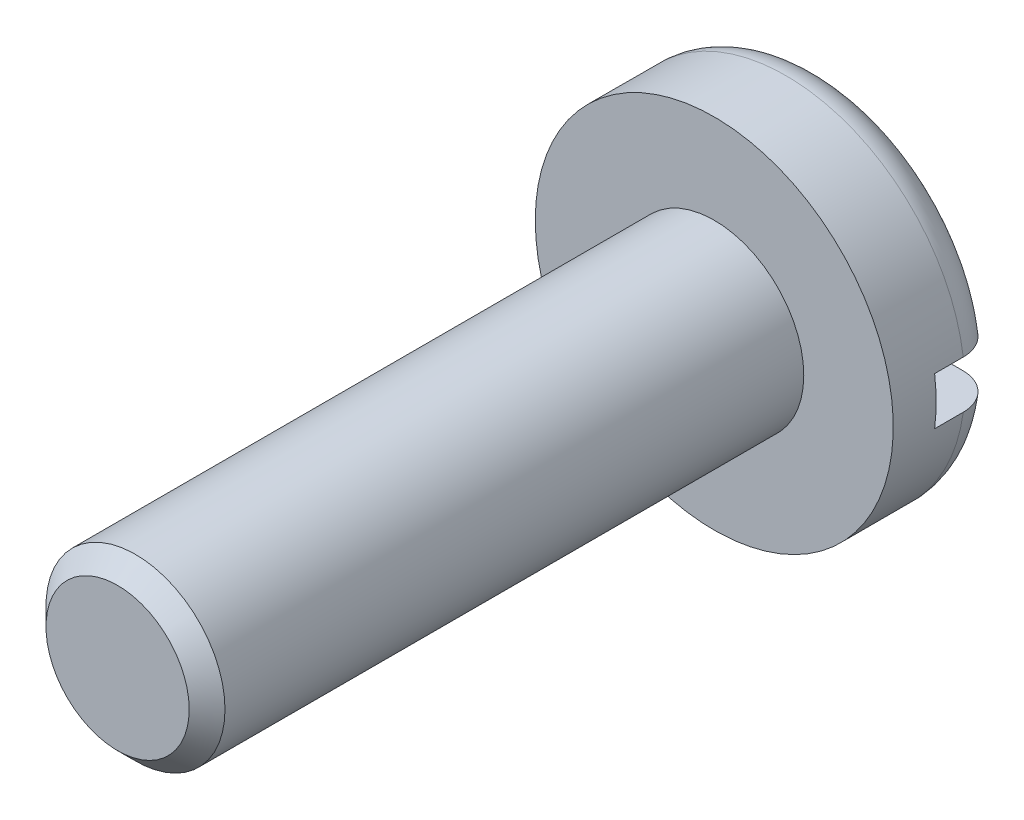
from build123d import *

# Parameters (mm, degrees)
ESQUISSE2_W             = 6
ESQUISSE2_H             = 0.8
ENLEV_MAT_EXTRU_1_DEPTH = 1.08
ESQUISSE3_W             = 1.5
ESQUISSE3_H             = 10
CHANFREIN1_SIZE         = 0.3


with BuildPart() as part:
    # Esquisse1 → Base-R_volution (revolve)
    with BuildSketch(Plane(origin=(0, 0, 0), x_dir=(1, 0, 0), z_dir=(0, 1, 0)), mode=Mode.PRIVATE) as base_r_volution_sk:
        with BuildLine():
            Line((0, 0), (3, 0))
            Line((3, 0), (3, 1.2))
            ThreePointArc((3, 1.2), (2.824264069, 1.624264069), (2.4, 1.8))
            Line((2.4, 1.8), (0, 1.8))
            Line((0, 1.8), (0, 0))
        make_face()
    revolve(base_r_volution_sk.sketch.rotate(Axis((0, 0, 0), (0, 0, -1)), 180), axis=Axis((0, 0, 0), (0, 0, -1)))

    # Esquisse2 → Enlev. mat.-Extru.1 (cut)
    with BuildSketch(Plane.XY.offset(-1.8)):
        Rectangle(ESQUISSE2_W, ESQUISSE2_H)
    extrude(amount=ENLEV_MAT_EXTRU_1_DEPTH, mode=Mode.SUBTRACT)

    # Esquisse3 → Boss.-R_vol.1 (revolve)
    with BuildSketch(Plane(origin=(0, 0, 0), x_dir=(1, 0, 0), z_dir=(0, 1, 0))):
        with Locations((0.75, -5)):
            Rectangle(ESQUISSE3_W, ESQUISSE3_H)
    revolve(axis=Axis((0, 0, 0), (0, 0, 1)))

    # Chanfrein1
    chanfrein1_edges = [part.edges().sort_by_distance(p)[0] for p in [
        (-1.5, 0, 10),
    ]]
    chamfer(chanfrein1_edges, length=CHANFREIN1_SIZE)


solid = part.part
